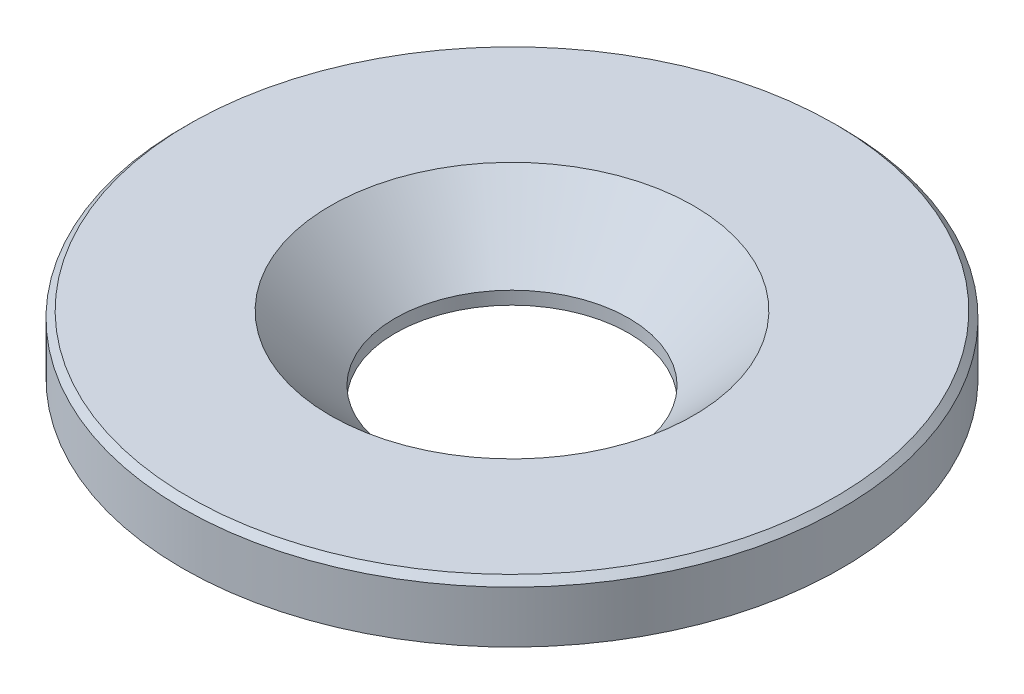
ISO-10303-21;
HEADER;
FILE_DESCRIPTION(('STEP AP214'),'2;1');
FILE_NAME('part.step','',(''),(''),'','','');
FILE_SCHEMA(('AUTOMOTIVE_DESIGN { 1 0 10303 214 1 1 1 1 }'));
ENDSEC;
DATA;
#1=APPLICATION_CONTEXT('core data for automotive mechanical design processes');
#2=APPLICATION_PROTOCOL_DEFINITION('international standard','automotive_design',2000,#1);
#3=PRODUCT_CONTEXT('',#1,'mechanical');
#4=PRODUCT('Part','Part','',(#3));
#5=PRODUCT_RELATED_PRODUCT_CATEGORY('part','',(#4));
#6=PRODUCT_DEFINITION_FORMATION('','',#4);
#7=PRODUCT_DEFINITION_CONTEXT('part definition',#1,'design');
#8=PRODUCT_DEFINITION('design','',#6,#7);
#9=PRODUCT_DEFINITION_SHAPE('','',#8);
#10=(LENGTH_UNIT() NAMED_UNIT(*) SI_UNIT(.MILLI.,.METRE.));
#11=(NAMED_UNIT(*) PLANE_ANGLE_UNIT() SI_UNIT($,.RADIAN.));
#12=(NAMED_UNIT(*) SI_UNIT($,.STERADIAN.) SOLID_ANGLE_UNIT());
#13=UNCERTAINTY_MEASURE_WITH_UNIT(LENGTH_MEASURE(1.E-05),#10,'distance_accuracy_value','');
#14=(GEOMETRIC_REPRESENTATION_CONTEXT(3) GLOBAL_UNCERTAINTY_ASSIGNED_CONTEXT((#13)) GLOBAL_UNIT_ASSIGNED_CONTEXT((#10,
#11,#12)) REPRESENTATION_CONTEXT('',''));
#15=CARTESIAN_POINT('',(0.,0.,0.));
#16=DIRECTION('',(0.,0.,1.));
#17=DIRECTION('',(1.,0.,0.));
#18=AXIS2_PLACEMENT_3D('',#15,#16,#17);
#19=CARTESIAN_POINT('',(0.,0.,0.));
#20=DIRECTION('',(0.,-1.,0.));
#21=DIRECTION('',(0.,0.,-1.));
#22=AXIS2_PLACEMENT_3D('',#19,#20,#21);
#23=CYLINDRICAL_SURFACE('',#22,18.);
#24=CARTESIAN_POINT('',(0.,2.,0.));
#25=DIRECTION('',(0.,-1.,0.));
#26=DIRECTION('',(0.,0.,-1.));
#27=AXIS2_PLACEMENT_3D('',#24,#25,#26);
#28=CIRCLE('',#27,18.);
#29=CARTESIAN_POINT('',(0.,2.,-18.));
#30=VERTEX_POINT('',#29);
#31=EDGE_CURVE('E34',#30,#30,#28,.T.);
#32=ORIENTED_EDGE('',*,*,#31,.F.);
#33=EDGE_LOOP('',(#32));
#34=FACE_BOUND('',#33,.T.);
#35=CARTESIAN_POINT('',(0.,0.,0.));
#36=DIRECTION('',(0.,-1.,0.));
#37=DIRECTION('',(0.,0.,-1.));
#38=AXIS2_PLACEMENT_3D('',#35,#36,#37);
#39=CIRCLE('',#38,18.);
#40=CARTESIAN_POINT('',(0.,0.,-18.));
#41=VERTEX_POINT('',#40);
#42=EDGE_CURVE('E46',#41,#41,#39,.T.);
#43=ORIENTED_EDGE('',*,*,#42,.T.);
#44=EDGE_LOOP('',(#43));
#45=FACE_BOUND('',#44,.T.);
#46=ADVANCED_FACE('F14',(#34,#45),#23,.F.);
#47=CARTESIAN_POINT('',(0.,2.,0.));
#48=DIRECTION('',(0.,1.,0.));
#49=DIRECTION('',(0.,0.,1.));
#50=AXIS2_PLACEMENT_3D('',#47,#48,#49);
#51=CONICAL_SURFACE('',#50,18.,0.78539816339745);
#52=CARTESIAN_POINT('',(0.,12.,0.));
#53=DIRECTION('',(0.,-1.,0.));
#54=DIRECTION('',(0.,0.,-1.));
#55=AXIS2_PLACEMENT_3D('',#52,#53,#54);
#56=CIRCLE('',#55,28.);
#57=CARTESIAN_POINT('',(0.,12.,-28.));
#58=VERTEX_POINT('',#57);
#59=EDGE_CURVE('E37',#58,#58,#56,.T.);
#60=ORIENTED_EDGE('',*,*,#59,.F.);
#61=EDGE_LOOP('',(#60));
#62=FACE_BOUND('',#61,.T.);
#63=ORIENTED_EDGE('',*,*,#31,.T.);
#64=EDGE_LOOP('',(#63));
#65=FACE_BOUND('',#64,.T.);
#66=ADVANCED_FACE('F68',(#62,#65),#51,.F.);
#67=CARTESIAN_POINT('',(-28.,12.,0.));
#68=DIRECTION('',(0.,-1.,0.));
#69=DIRECTION('',(0.,0.,-1.));
#70=AXIS2_PLACEMENT_3D('',#67,#68,#69);
#71=PLANE('',#70);
#72=CARTESIAN_POINT('',(0.,12.,0.));
#73=DIRECTION('',(0.,-1.,0.));
#74=DIRECTION('',(0.,0.,-1.));
#75=AXIS2_PLACEMENT_3D('',#72,#73,#74);
#76=CIRCLE('',#75,49.8);
#77=CARTESIAN_POINT('',(0.,12.,-49.8));
#78=VERTEX_POINT('',#77);
#79=EDGE_CURVE('E9',#78,#78,#76,.F.);
#80=ORIENTED_EDGE('',*,*,#79,.T.);
#81=EDGE_LOOP('',(#80));
#82=FACE_BOUND('',#81,.T.);
#83=ORIENTED_EDGE('',*,*,#59,.T.);
#84=EDGE_LOOP('',(#83));
#85=FACE_BOUND('',#84,.T.);
#86=ADVANCED_FACE('F75',(#82,#85),#71,.F.);
#87=CARTESIAN_POINT('',(0.,0.,0.));
#88=DIRECTION('',(0.,-1.,0.));
#89=DIRECTION('',(0.,0.,-1.));
#90=AXIS2_PLACEMENT_3D('',#87,#88,#89);
#91=CYLINDRICAL_SURFACE('',#90,50.8);
#92=CARTESIAN_POINT('',(0.,11.,0.));
#93=DIRECTION('',(0.,-1.,0.));
#94=DIRECTION('',(0.,0.,-1.));
#95=AXIS2_PLACEMENT_3D('',#92,#93,#94);
#96=CIRCLE('',#95,50.8);
#97=CARTESIAN_POINT('',(0.,11.,-50.8));
#98=VERTEX_POINT('',#97);
#99=EDGE_CURVE('E21',#98,#98,#96,.T.);
#100=ORIENTED_EDGE('',*,*,#99,.T.);
#101=EDGE_LOOP('',(#100));
#102=FACE_BOUND('',#101,.T.);
#103=CARTESIAN_POINT('',(0.,3.,0.));
#104=DIRECTION('',(0.,-1.,0.));
#105=DIRECTION('',(0.,0.,-1.));
#106=AXIS2_PLACEMENT_3D('',#103,#104,#105);
#107=CIRCLE('',#106,50.8);
#108=CARTESIAN_POINT('',(0.,3.,-50.8));
#109=VERTEX_POINT('',#108);
#110=EDGE_CURVE('E40',#109,#109,#107,.T.);
#111=ORIENTED_EDGE('',*,*,#110,.F.);
#112=EDGE_LOOP('',(#111));
#113=FACE_BOUND('',#112,.T.);
#114=ADVANCED_FACE('F82',(#102,#113),#91,.T.);
#115=CARTESIAN_POINT('',(-45.,3.,0.));
#116=DIRECTION('',(0.,1.,0.));
#117=DIRECTION('',(0.,0.,1.));
#118=AXIS2_PLACEMENT_3D('',#115,#116,#117);
#119=PLANE('',#118);
#120=CARTESIAN_POINT('',(0.,3.,0.));
#121=DIRECTION('',(0.,-1.,0.));
#122=DIRECTION('',(0.,0.,-1.));
#123=AXIS2_PLACEMENT_3D('',#120,#121,#122);
#124=CIRCLE('',#123,45.);
#125=CARTESIAN_POINT('',(0.,3.,-45.));
#126=VERTEX_POINT('',#125);
#127=EDGE_CURVE('E43',#126,#126,#124,.T.);
#128=ORIENTED_EDGE('',*,*,#127,.F.);
#129=EDGE_LOOP('',(#128));
#130=FACE_BOUND('',#129,.T.);
#131=ORIENTED_EDGE('',*,*,#110,.T.);
#132=EDGE_LOOP('',(#131));
#133=FACE_BOUND('',#132,.T.);
#134=ADVANCED_FACE('F64',(#130,#133),#119,.F.);
#135=CARTESIAN_POINT('',(0.,0.,0.));
#136=DIRECTION('',(0.,-1.,0.));
#137=DIRECTION('',(0.,0.,-1.));
#138=AXIS2_PLACEMENT_3D('',#135,#136,#137);
#139=CYLINDRICAL_SURFACE('',#138,45.);
#140=CARTESIAN_POINT('',(0.,1.,0.));
#141=DIRECTION('',(0.,1.,0.));
#142=DIRECTION('',(0.,0.,1.));
#143=AXIS2_PLACEMENT_3D('',#140,#141,#142);
#144=CIRCLE('',#143,45.);
#145=CARTESIAN_POINT('',(0.,1.,45.));
#146=VERTEX_POINT('',#145);
#147=EDGE_CURVE('E25',#146,#146,#144,.T.);
#148=ORIENTED_EDGE('',*,*,#147,.T.);
#149=EDGE_LOOP('',(#148));
#150=FACE_BOUND('',#149,.T.);
#151=ORIENTED_EDGE('',*,*,#127,.T.);
#152=EDGE_LOOP('',(#151));
#153=FACE_BOUND('',#152,.T.);
#154=ADVANCED_FACE('F54',(#150,#153),#139,.T.);
#155=CARTESIAN_POINT('',(-18.,0.,0.));
#156=DIRECTION('',(0.,1.,0.));
#157=DIRECTION('',(0.,0.,1.));
#158=AXIS2_PLACEMENT_3D('',#155,#156,#157);
#159=PLANE('',#158);
#160=CARTESIAN_POINT('',(0.,0.,0.));
#161=DIRECTION('',(0.,1.,0.));
#162=DIRECTION('',(0.,0.,1.));
#163=AXIS2_PLACEMENT_3D('',#160,#161,#162);
#164=CIRCLE('',#163,44.);
#165=CARTESIAN_POINT('',(0.,0.,44.));
#166=VERTEX_POINT('',#165);
#167=EDGE_CURVE('E29',#166,#166,#164,.F.);
#168=ORIENTED_EDGE('',*,*,#167,.T.);
#169=EDGE_LOOP('',(#168));
#170=FACE_BOUND('',#169,.T.);
#171=ORIENTED_EDGE('',*,*,#42,.F.);
#172=EDGE_LOOP('',(#171));
#173=FACE_BOUND('',#172,.T.);
#174=ADVANCED_FACE('F51',(#170,#173),#159,.F.);
#175=CARTESIAN_POINT('',(0.,0.,0.));
#176=DIRECTION('',(0.,1.,0.));
#177=DIRECTION('',(0.,0.,1.));
#178=AXIS2_PLACEMENT_3D('',#175,#176,#177);
#179=CONICAL_SURFACE('',#178,44.,0.785398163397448);
#180=ORIENTED_EDGE('',*,*,#147,.F.);
#181=EDGE_LOOP('',(#180));
#182=FACE_BOUND('',#181,.T.);
#183=ORIENTED_EDGE('',*,*,#167,.F.);
#184=EDGE_LOOP('',(#183));
#185=FACE_BOUND('',#184,.T.);
#186=ADVANCED_FACE('F53',(#182,#185),#179,.T.);
#187=CARTESIAN_POINT('',(0.,11.,0.));
#188=DIRECTION('',(0.,-1.,0.));
#189=DIRECTION('',(0.,0.,-1.));
#190=AXIS2_PLACEMENT_3D('',#187,#188,#189);
#191=CONICAL_SURFACE('',#190,50.8,0.785398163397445);
#192=ORIENTED_EDGE('',*,*,#79,.F.);
#193=EDGE_LOOP('',(#192));
#194=FACE_BOUND('',#193,.T.);
#195=ORIENTED_EDGE('',*,*,#99,.F.);
#196=EDGE_LOOP('',(#195));
#197=FACE_BOUND('',#196,.T.);
#198=ADVANCED_FACE('F16',(#194,#197),#191,.T.);
#199=CLOSED_SHELL('',(#46,#66,#86,#114,#134,#154,#174,#186,#198));
#200=MANIFOLD_SOLID_BREP('B1',#199);
#201=ADVANCED_BREP_SHAPE_REPRESENTATION('',(#18,#200),#14);
#202=SHAPE_DEFINITION_REPRESENTATION(#9,#201);
ENDSEC;
END-ISO-10303-21;
